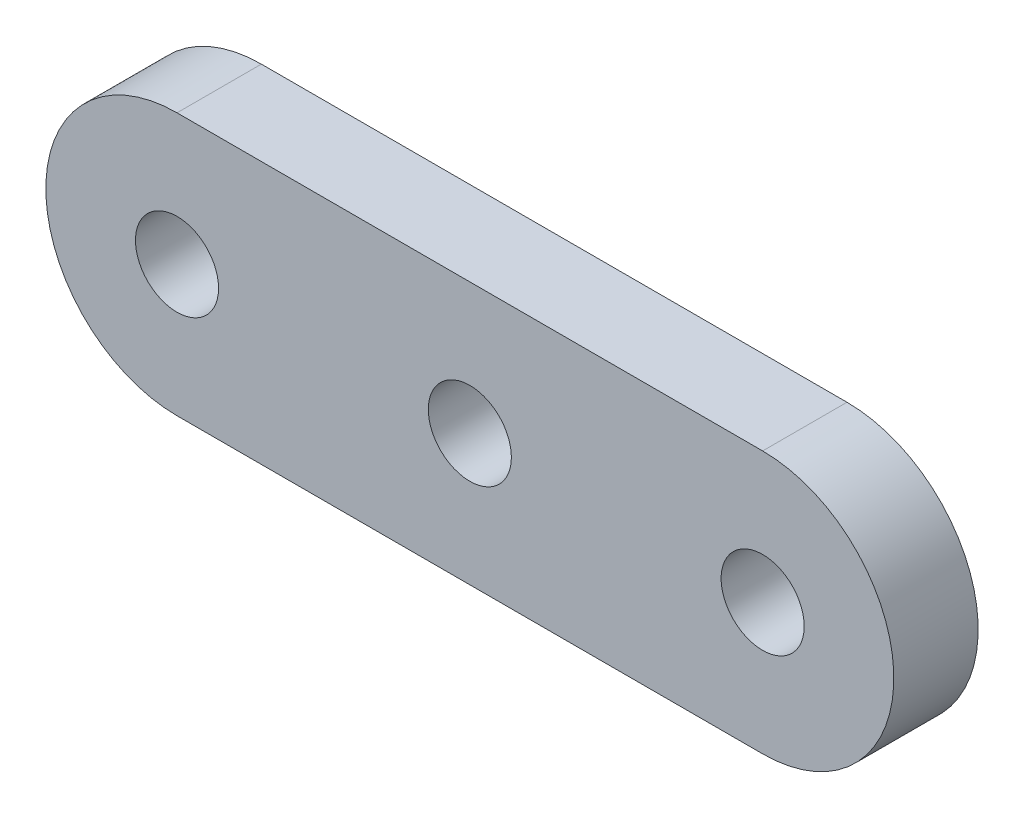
ISO-10303-21;
HEADER;
FILE_DESCRIPTION(('STEP AP214'),'2;1');
FILE_NAME('part.step','',(''),(''),'','','');
FILE_SCHEMA(('AUTOMOTIVE_DESIGN { 1 0 10303 214 1 1 1 1 }'));
ENDSEC;
DATA;
#1=APPLICATION_CONTEXT('core data for automotive mechanical design processes');
#2=APPLICATION_PROTOCOL_DEFINITION('international standard','automotive_design',2000,#1);
#3=PRODUCT_CONTEXT('',#1,'mechanical');
#4=PRODUCT('Part','Part','',(#3));
#5=PRODUCT_RELATED_PRODUCT_CATEGORY('part','',(#4));
#6=PRODUCT_DEFINITION_FORMATION('','',#4);
#7=PRODUCT_DEFINITION_CONTEXT('part definition',#1,'design');
#8=PRODUCT_DEFINITION('design','',#6,#7);
#9=PRODUCT_DEFINITION_SHAPE('','',#8);
#10=(LENGTH_UNIT() NAMED_UNIT(*) SI_UNIT(.MILLI.,.METRE.));
#11=(NAMED_UNIT(*) PLANE_ANGLE_UNIT() SI_UNIT($,.RADIAN.));
#12=(NAMED_UNIT(*) SI_UNIT($,.STERADIAN.) SOLID_ANGLE_UNIT());
#13=UNCERTAINTY_MEASURE_WITH_UNIT(LENGTH_MEASURE(1.E-05),#10,'distance_accuracy_value','');
#14=(GEOMETRIC_REPRESENTATION_CONTEXT(3) GLOBAL_UNCERTAINTY_ASSIGNED_CONTEXT((#13)) GLOBAL_UNIT_ASSIGNED_CONTEXT((#10,
#11,#12)) REPRESENTATION_CONTEXT('',''));
#15=CARTESIAN_POINT('',(0.,0.,0.));
#16=DIRECTION('',(0.,0.,1.));
#17=DIRECTION('',(1.,0.,0.));
#18=AXIS2_PLACEMENT_3D('',#15,#16,#17);
#19=CARTESIAN_POINT('',(-15.875,0.,-2.286));
#20=DIRECTION('',(0.,0.,1.));
#21=DIRECTION('',(1.,0.,0.));
#22=AXIS2_PLACEMENT_3D('',#19,#20,#21);
#23=CYLINDRICAL_SURFACE('',#22,10.668);
#24=CARTESIAN_POINT('',(-15.875,0.,4.572));
#25=DIRECTION('',(0.,0.,1.));
#26=DIRECTION('',(1.,0.,0.));
#27=AXIS2_PLACEMENT_3D('',#24,#25,#26);
#28=CIRCLE('',#27,10.668);
#29=CARTESIAN_POINT('',(-15.875,10.668,4.572));
#30=VERTEX_POINT('',#29);
#31=CARTESIAN_POINT('',(-15.875,-10.668,4.572));
#32=VERTEX_POINT('',#31);
#33=EDGE_CURVE('E81',#30,#32,#28,.T.);
#34=ORIENTED_EDGE('',*,*,#33,.F.);
#35=DIRECTION('',(0.,0.,1.));
#36=VECTOR('',#35,1.);
#37=CARTESIAN_POINT('',(-15.875,10.668,-2.286));
#38=LINE('',#37,#36);
#39=CARTESIAN_POINT('',(-15.875,10.668,-2.286));
#40=VERTEX_POINT('',#39);
#41=EDGE_CURVE('E10',#40,#30,#38,.T.);
#42=ORIENTED_EDGE('',*,*,#41,.F.);
#43=CARTESIAN_POINT('',(-15.875,0.,-2.286));
#44=DIRECTION('',(0.,0.,1.));
#45=DIRECTION('',(1.,0.,0.));
#46=AXIS2_PLACEMENT_3D('',#43,#44,#45);
#47=CIRCLE('',#46,10.668);
#48=CARTESIAN_POINT('',(-15.875,-10.668,-2.286));
#49=VERTEX_POINT('',#48);
#50=EDGE_CURVE('E74',#40,#49,#47,.T.);
#51=ORIENTED_EDGE('',*,*,#50,.T.);
#52=DIRECTION('',(0.,0.,1.));
#53=VECTOR('',#52,1.);
#54=CARTESIAN_POINT('',(-15.875,-10.668,-2.286));
#55=LINE('',#54,#53);
#56=EDGE_CURVE('E19',#49,#32,#55,.T.);
#57=ORIENTED_EDGE('',*,*,#56,.T.);
#58=EDGE_LOOP('',(#34,#42,#51,#57));
#59=FACE_BOUND('',#58,.T.);
#60=ADVANCED_FACE('F16',(#59),#23,.T.);
#61=CARTESIAN_POINT('',(-15.875,10.668,-2.286));
#62=DIRECTION('',(0.,1.,0.));
#63=DIRECTION('',(-1.,0.,0.));
#64=AXIS2_PLACEMENT_3D('',#61,#62,#63);
#65=PLANE('',#64);
#66=DIRECTION('',(-1.,0.,0.));
#67=VECTOR('',#66,1.);
#68=CARTESIAN_POINT('',(-15.875,10.668,4.572));
#69=LINE('',#68,#67);
#70=CARTESIAN_POINT('',(31.75,10.668,4.572));
#71=VERTEX_POINT('',#70);
#72=EDGE_CURVE('E76',#71,#30,#69,.T.);
#73=ORIENTED_EDGE('',*,*,#72,.F.);
#74=DIRECTION('',(0.,0.,1.));
#75=VECTOR('',#74,1.);
#76=CARTESIAN_POINT('',(31.75,10.668,-2.286));
#77=LINE('',#76,#75);
#78=CARTESIAN_POINT('',(31.75,10.668,-2.286));
#79=VERTEX_POINT('',#78);
#80=EDGE_CURVE('E25',#79,#71,#77,.T.);
#81=ORIENTED_EDGE('',*,*,#80,.F.);
#82=DIRECTION('',(-1.,0.,0.));
#83=VECTOR('',#82,1.);
#84=CARTESIAN_POINT('',(-15.875,10.668,-2.286));
#85=LINE('',#84,#83);
#86=EDGE_CURVE('E71',#79,#40,#85,.T.);
#87=ORIENTED_EDGE('',*,*,#86,.T.);
#88=ORIENTED_EDGE('',*,*,#41,.T.);
#89=EDGE_LOOP('',(#73,#81,#87,#88));
#90=FACE_BOUND('',#89,.T.);
#91=ADVANCED_FACE('F92',(#90),#65,.T.);
#92=CARTESIAN_POINT('',(31.75,0.,-2.286));
#93=DIRECTION('',(0.,0.,1.));
#94=DIRECTION('',(1.,0.,0.));
#95=AXIS2_PLACEMENT_3D('',#92,#93,#94);
#96=CYLINDRICAL_SURFACE('',#95,10.668);
#97=CARTESIAN_POINT('',(31.75,0.,4.572));
#98=DIRECTION('',(0.,0.,1.));
#99=DIRECTION('',(1.,0.,0.));
#100=AXIS2_PLACEMENT_3D('',#97,#98,#99);
#101=CIRCLE('',#100,10.668);
#102=CARTESIAN_POINT('',(31.75,-10.668,4.572));
#103=VERTEX_POINT('',#102);
#104=EDGE_CURVE('E66',#103,#71,#101,.T.);
#105=ORIENTED_EDGE('',*,*,#104,.F.);
#106=DIRECTION('',(0.,0.,1.));
#107=VECTOR('',#106,1.);
#108=CARTESIAN_POINT('',(31.75,-10.668,-2.286));
#109=LINE('',#108,#107);
#110=CARTESIAN_POINT('',(31.75,-10.668,-2.286));
#111=VERTEX_POINT('',#110);
#112=EDGE_CURVE('E61',#111,#103,#109,.T.);
#113=ORIENTED_EDGE('',*,*,#112,.F.);
#114=CARTESIAN_POINT('',(31.75,0.,-2.286));
#115=DIRECTION('',(0.,0.,1.));
#116=DIRECTION('',(1.,0.,0.));
#117=AXIS2_PLACEMENT_3D('',#114,#115,#116);
#118=CIRCLE('',#117,10.668);
#119=EDGE_CURVE('E64',#111,#79,#118,.T.);
#120=ORIENTED_EDGE('',*,*,#119,.T.);
#121=ORIENTED_EDGE('',*,*,#80,.T.);
#122=EDGE_LOOP('',(#105,#113,#120,#121));
#123=FACE_BOUND('',#122,.T.);
#124=ADVANCED_FACE('F63',(#123),#96,.T.);
#125=CARTESIAN_POINT('',(31.75,-10.668,-2.286));
#126=DIRECTION('',(0.,-1.,0.));
#127=DIRECTION('',(1.,0.,0.));
#128=AXIS2_PLACEMENT_3D('',#125,#126,#127);
#129=PLANE('',#128);
#130=DIRECTION('',(1.,0.,0.));
#131=VECTOR('',#130,1.);
#132=CARTESIAN_POINT('',(31.75,-10.668,4.572));
#133=LINE('',#132,#131);
#134=EDGE_CURVE('E84',#32,#103,#133,.T.);
#135=ORIENTED_EDGE('',*,*,#134,.F.);
#136=ORIENTED_EDGE('',*,*,#56,.F.);
#137=DIRECTION('',(1.,0.,0.));
#138=VECTOR('',#137,1.);
#139=CARTESIAN_POINT('',(31.75,-10.668,-2.286));
#140=LINE('',#139,#138);
#141=EDGE_CURVE('E70',#49,#111,#140,.T.);
#142=ORIENTED_EDGE('',*,*,#141,.T.);
#143=ORIENTED_EDGE('',*,*,#112,.T.);
#144=EDGE_LOOP('',(#135,#136,#142,#143));
#145=FACE_BOUND('',#144,.T.);
#146=ADVANCED_FACE('F73',(#145),#129,.T.);
#147=CARTESIAN_POINT('',(-15.875,0.,-2.286));
#148=DIRECTION('',(0.,0.,1.));
#149=DIRECTION('',(1.,0.,0.));
#150=AXIS2_PLACEMENT_3D('',#147,#148,#149);
#151=PLANE('',#150);
#152=CARTESIAN_POINT('',(31.75,0.,-2.286));
#153=DIRECTION('',(0.,0.,1.));
#154=DIRECTION('',(1.,0.,0.));
#155=AXIS2_PLACEMENT_3D('',#152,#153,#154);
#156=CIRCLE('',#155,3.3782);
#157=CARTESIAN_POINT('',(35.1282,0.,-2.286));
#158=VERTEX_POINT('',#157);
#159=EDGE_CURVE('E130',#158,#158,#156,.T.);
#160=ORIENTED_EDGE('',*,*,#159,.T.);
#161=EDGE_LOOP('',(#160));
#162=FACE_BOUND('',#161,.T.);
#163=CARTESIAN_POINT('',(7.9375,0.,-2.286));
#164=DIRECTION('',(0.,0.,1.));
#165=DIRECTION('',(1.,0.,0.));
#166=AXIS2_PLACEMENT_3D('',#163,#164,#165);
#167=CIRCLE('',#166,3.3782);
#168=CARTESIAN_POINT('',(11.3157,0.,-2.286));
#169=VERTEX_POINT('',#168);
#170=EDGE_CURVE('E138',#169,#169,#167,.T.);
#171=ORIENTED_EDGE('',*,*,#170,.T.);
#172=EDGE_LOOP('',(#171));
#173=FACE_BOUND('',#172,.T.);
#174=CARTESIAN_POINT('',(-15.875,0.,-2.286));
#175=DIRECTION('',(0.,0.,1.));
#176=DIRECTION('',(1.,0.,0.));
#177=AXIS2_PLACEMENT_3D('',#174,#175,#176);
#178=CIRCLE('',#177,3.3782);
#179=CARTESIAN_POINT('',(-12.4968,0.,-2.286));
#180=VERTEX_POINT('',#179);
#181=EDGE_CURVE('E85',#180,#180,#178,.T.);
#182=ORIENTED_EDGE('',*,*,#181,.T.);
#183=EDGE_LOOP('',(#182));
#184=FACE_BOUND('',#183,.T.);
#185=ORIENTED_EDGE('',*,*,#50,.F.);
#186=ORIENTED_EDGE('',*,*,#86,.F.);
#187=ORIENTED_EDGE('',*,*,#119,.F.);
#188=ORIENTED_EDGE('',*,*,#141,.F.);
#189=EDGE_LOOP('',(#185,#186,#187,#188));
#190=FACE_BOUND('',#189,.T.);
#191=ADVANCED_FACE('F69',(#162,#173,#184,#190),#151,.F.);
#192=CARTESIAN_POINT('',(-15.875,0.,4.572));
#193=DIRECTION('',(0.,0.,1.));
#194=DIRECTION('',(1.,0.,0.));
#195=AXIS2_PLACEMENT_3D('',#192,#193,#194);
#196=PLANE('',#195);
#197=CARTESIAN_POINT('',(31.75,0.,4.572));
#198=DIRECTION('',(0.,0.,1.));
#199=DIRECTION('',(1.,0.,0.));
#200=AXIS2_PLACEMENT_3D('',#197,#198,#199);
#201=CIRCLE('',#200,3.3782);
#202=CARTESIAN_POINT('',(35.1282,0.,4.572));
#203=VERTEX_POINT('',#202);
#204=EDGE_CURVE('E133',#203,#203,#201,.T.);
#205=ORIENTED_EDGE('',*,*,#204,.F.);
#206=EDGE_LOOP('',(#205));
#207=FACE_BOUND('',#206,.T.);
#208=CARTESIAN_POINT('',(7.9375,0.,4.572));
#209=DIRECTION('',(0.,0.,1.));
#210=DIRECTION('',(1.,0.,0.));
#211=AXIS2_PLACEMENT_3D('',#208,#209,#210);
#212=CIRCLE('',#211,3.3782);
#213=CARTESIAN_POINT('',(11.3157,0.,4.572));
#214=VERTEX_POINT('',#213);
#215=EDGE_CURVE('E135',#214,#214,#212,.T.);
#216=ORIENTED_EDGE('',*,*,#215,.F.);
#217=EDGE_LOOP('',(#216));
#218=FACE_BOUND('',#217,.T.);
#219=CARTESIAN_POINT('',(-15.875,0.,4.572));
#220=DIRECTION('',(0.,0.,1.));
#221=DIRECTION('',(1.,0.,0.));
#222=AXIS2_PLACEMENT_3D('',#219,#220,#221);
#223=CIRCLE('',#222,3.3782);
#224=CARTESIAN_POINT('',(-12.4968,0.,4.572));
#225=VERTEX_POINT('',#224);
#226=EDGE_CURVE('E141',#225,#225,#223,.T.);
#227=ORIENTED_EDGE('',*,*,#226,.F.);
#228=EDGE_LOOP('',(#227));
#229=FACE_BOUND('',#228,.T.);
#230=ORIENTED_EDGE('',*,*,#33,.T.);
#231=ORIENTED_EDGE('',*,*,#134,.T.);
#232=ORIENTED_EDGE('',*,*,#104,.T.);
#233=ORIENTED_EDGE('',*,*,#72,.T.);
#234=EDGE_LOOP('',(#230,#231,#232,#233));
#235=FACE_BOUND('',#234,.T.);
#236=ADVANCED_FACE('F91',(#207,#218,#229,#235),#196,.T.);
#237=CARTESIAN_POINT('',(-15.875,0.,-2.286));
#238=DIRECTION('',(0.,0.,1.));
#239=DIRECTION('',(1.,0.,0.));
#240=AXIS2_PLACEMENT_3D('',#237,#238,#239);
#241=CYLINDRICAL_SURFACE('',#240,3.3782);
#242=ORIENTED_EDGE('',*,*,#181,.F.);
#243=EDGE_LOOP('',(#242));
#244=FACE_BOUND('',#243,.T.);
#245=ORIENTED_EDGE('',*,*,#226,.T.);
#246=EDGE_LOOP('',(#245));
#247=FACE_BOUND('',#246,.T.);
#248=ADVANCED_FACE('F111',(#244,#247),#241,.F.);
#249=CARTESIAN_POINT('',(7.9375,0.,-2.286));
#250=DIRECTION('',(0.,0.,1.));
#251=DIRECTION('',(1.,0.,0.));
#252=AXIS2_PLACEMENT_3D('',#249,#250,#251);
#253=CYLINDRICAL_SURFACE('',#252,3.3782);
#254=ORIENTED_EDGE('',*,*,#170,.F.);
#255=EDGE_LOOP('',(#254));
#256=FACE_BOUND('',#255,.T.);
#257=ORIENTED_EDGE('',*,*,#215,.T.);
#258=EDGE_LOOP('',(#257));
#259=FACE_BOUND('',#258,.T.);
#260=ADVANCED_FACE('F118',(#256,#259),#253,.F.);
#261=CARTESIAN_POINT('',(31.75,0.,-2.286));
#262=DIRECTION('',(0.,0.,1.));
#263=DIRECTION('',(1.,0.,0.));
#264=AXIS2_PLACEMENT_3D('',#261,#262,#263);
#265=CYLINDRICAL_SURFACE('',#264,3.3782);
#266=ORIENTED_EDGE('',*,*,#159,.F.);
#267=EDGE_LOOP('',(#266));
#268=FACE_BOUND('',#267,.T.);
#269=ORIENTED_EDGE('',*,*,#204,.T.);
#270=EDGE_LOOP('',(#269));
#271=FACE_BOUND('',#270,.T.);
#272=ADVANCED_FACE('F122',(#268,#271),#265,.F.);
#273=CLOSED_SHELL('',(#60,#91,#124,#146,#191,#236,#248,#260,#272));
#274=MANIFOLD_SOLID_BREP('B1',#273);
#275=ADVANCED_BREP_SHAPE_REPRESENTATION('',(#18,#274),#14);
#276=SHAPE_DEFINITION_REPRESENTATION(#9,#275);
ENDSEC;
END-ISO-10303-21;
